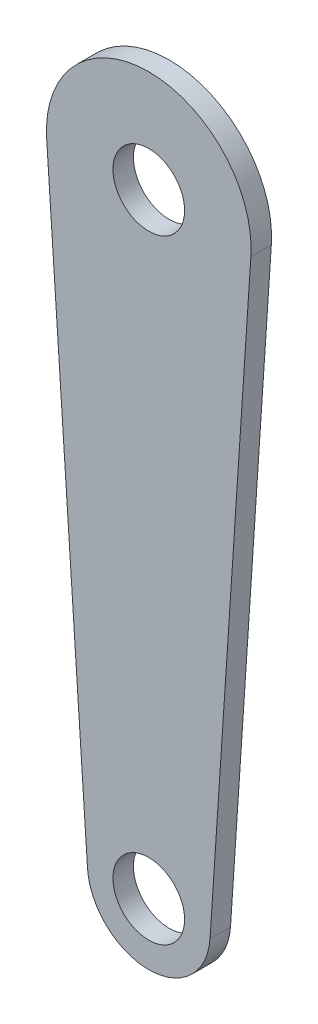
ISO-10303-21;
HEADER;
FILE_DESCRIPTION(('STEP AP214'),'2;1');
FILE_NAME('part.step','',(''),(''),'','','');
FILE_SCHEMA(('AUTOMOTIVE_DESIGN { 1 0 10303 214 1 1 1 1 }'));
ENDSEC;
DATA;
#1=APPLICATION_CONTEXT('core data for automotive mechanical design processes');
#2=APPLICATION_PROTOCOL_DEFINITION('international standard','automotive_design',2000,#1);
#3=PRODUCT_CONTEXT('',#1,'mechanical');
#4=PRODUCT('Part','Part','',(#3));
#5=PRODUCT_RELATED_PRODUCT_CATEGORY('part','',(#4));
#6=PRODUCT_DEFINITION_FORMATION('','',#4);
#7=PRODUCT_DEFINITION_CONTEXT('part definition',#1,'design');
#8=PRODUCT_DEFINITION('design','',#6,#7);
#9=PRODUCT_DEFINITION_SHAPE('','',#8);
#10=(LENGTH_UNIT() NAMED_UNIT(*) SI_UNIT(.MILLI.,.METRE.));
#11=(NAMED_UNIT(*) PLANE_ANGLE_UNIT() SI_UNIT($,.RADIAN.));
#12=(NAMED_UNIT(*) SI_UNIT($,.STERADIAN.) SOLID_ANGLE_UNIT());
#13=UNCERTAINTY_MEASURE_WITH_UNIT(LENGTH_MEASURE(1.E-05),#10,'distance_accuracy_value','');
#14=(GEOMETRIC_REPRESENTATION_CONTEXT(3) GLOBAL_UNCERTAINTY_ASSIGNED_CONTEXT((#13)) GLOBAL_UNIT_ASSIGNED_CONTEXT((#10,
#11,#12)) REPRESENTATION_CONTEXT('',''));
#15=CARTESIAN_POINT('',(0.,0.,0.));
#16=DIRECTION('',(0.,0.,1.));
#17=DIRECTION('',(1.,0.,0.));
#18=AXIS2_PLACEMENT_3D('',#15,#16,#17);
#19=CARTESIAN_POINT('',(0.,30.,1.));
#20=DIRECTION('',(0.,0.,1.));
#21=DIRECTION('',(1.,0.,0.));
#22=AXIS2_PLACEMENT_3D('',#19,#20,#21);
#23=PLANE('',#22);
#24=CARTESIAN_POINT('',(0.,30.,1.));
#25=DIRECTION('',(0.,0.,1.));
#26=DIRECTION('',(1.,0.,0.));
#27=AXIS2_PLACEMENT_3D('',#24,#25,#26);
#28=CIRCLE('',#27,1.75);
#29=CARTESIAN_POINT('',(1.75,30.,1.));
#30=VERTEX_POINT('',#29);
#31=EDGE_CURVE('E97',#30,#30,#28,.T.);
#32=ORIENTED_EDGE('',*,*,#31,.F.);
#33=EDGE_LOOP('',(#32));
#34=FACE_BOUND('',#33,.T.);
#35=CARTESIAN_POINT('',(0.,30.,1.));
#36=DIRECTION('',(0.,0.,1.));
#37=DIRECTION('',(1.,0.,0.));
#38=AXIS2_PLACEMENT_3D('',#35,#36,#37);
#39=CIRCLE('',#38,5.);
#40=CARTESIAN_POINT('',(4.98887651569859,29.6666666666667,1.));
#41=VERTEX_POINT('',#40);
#42=CARTESIAN_POINT('',(-4.98887651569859,29.6666666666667,1.));
#43=VERTEX_POINT('',#42);
#44=EDGE_CURVE('E82',#41,#43,#39,.T.);
#45=ORIENTED_EDGE('',*,*,#44,.T.);
#46=DIRECTION('',(0.0666666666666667,-0.997775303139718,0.));
#47=VECTOR('',#46,1.);
#48=CARTESIAN_POINT('',(-4.98887651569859,29.6666666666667,1.));
#49=LINE('',#48,#47);
#50=CARTESIAN_POINT('',(-2.99332590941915,-0.2,1.));
#51=VERTEX_POINT('',#50);
#52=EDGE_CURVE('E77',#43,#51,#49,.T.);
#53=ORIENTED_EDGE('',*,*,#52,.T.);
#54=CARTESIAN_POINT('',(0.,0.,1.));
#55=DIRECTION('',(0.,0.,1.));
#56=DIRECTION('',(1.,0.,0.));
#57=AXIS2_PLACEMENT_3D('',#54,#55,#56);
#58=CIRCLE('',#57,3.);
#59=CARTESIAN_POINT('',(2.99332590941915,-0.2,1.));
#60=VERTEX_POINT('',#59);
#61=EDGE_CURVE('E80',#51,#60,#58,.T.);
#62=ORIENTED_EDGE('',*,*,#61,.T.);
#63=DIRECTION('',(0.0666666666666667,0.997775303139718,0.));
#64=VECTOR('',#63,1.);
#65=CARTESIAN_POINT('',(4.98887651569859,29.6666666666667,1.));
#66=LINE('',#65,#64);
#67=EDGE_CURVE('E47',#60,#41,#66,.T.);
#68=ORIENTED_EDGE('',*,*,#67,.T.);
#69=EDGE_LOOP('',(#45,#53,#62,#68));
#70=FACE_BOUND('',#69,.T.);
#71=CARTESIAN_POINT('',(0.,0.,1.));
#72=DIRECTION('',(0.,0.,1.));
#73=DIRECTION('',(1.,0.,0.));
#74=AXIS2_PLACEMENT_3D('',#71,#72,#73);
#75=CIRCLE('',#74,1.75);
#76=CARTESIAN_POINT('',(1.75,0.,1.));
#77=VERTEX_POINT('',#76);
#78=EDGE_CURVE('E112',#77,#77,#75,.T.);
#79=ORIENTED_EDGE('',*,*,#78,.F.);
#80=EDGE_LOOP('',(#79));
#81=FACE_BOUND('',#80,.T.);
#82=ADVANCED_FACE('F30',(#34,#70,#81),#23,.T.);
#83=CARTESIAN_POINT('',(0.,30.,0.));
#84=DIRECTION('',(0.,0.,1.));
#85=DIRECTION('',(1.,0.,0.));
#86=AXIS2_PLACEMENT_3D('',#83,#84,#85);
#87=PLANE('',#86);
#88=CARTESIAN_POINT('',(0.,30.,0.));
#89=DIRECTION('',(0.,0.,1.));
#90=DIRECTION('',(1.,0.,0.));
#91=AXIS2_PLACEMENT_3D('',#88,#89,#90);
#92=CIRCLE('',#91,1.75);
#93=CARTESIAN_POINT('',(1.75,30.,0.));
#94=VERTEX_POINT('',#93);
#95=EDGE_CURVE('E109',#94,#94,#92,.T.);
#96=ORIENTED_EDGE('',*,*,#95,.T.);
#97=EDGE_LOOP('',(#96));
#98=FACE_BOUND('',#97,.T.);
#99=CARTESIAN_POINT('',(0.,30.,0.));
#100=DIRECTION('',(0.,0.,1.));
#101=DIRECTION('',(1.,0.,0.));
#102=AXIS2_PLACEMENT_3D('',#99,#100,#101);
#103=CIRCLE('',#102,5.);
#104=CARTESIAN_POINT('',(4.98887651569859,29.6666666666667,0.));
#105=VERTEX_POINT('',#104);
#106=CARTESIAN_POINT('',(-4.98887651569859,29.6666666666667,0.));
#107=VERTEX_POINT('',#106);
#108=EDGE_CURVE('E94',#105,#107,#103,.T.);
#109=ORIENTED_EDGE('',*,*,#108,.F.);
#110=DIRECTION('',(0.0666666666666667,0.997775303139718,0.));
#111=VECTOR('',#110,1.);
#112=CARTESIAN_POINT('',(4.98887651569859,29.6666666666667,0.));
#113=LINE('',#112,#111);
#114=CARTESIAN_POINT('',(2.99332590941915,-0.2,0.));
#115=VERTEX_POINT('',#114);
#116=EDGE_CURVE('E70',#115,#105,#113,.T.);
#117=ORIENTED_EDGE('',*,*,#116,.F.);
#118=CARTESIAN_POINT('',(0.,0.,0.));
#119=DIRECTION('',(0.,0.,1.));
#120=DIRECTION('',(1.,0.,0.));
#121=AXIS2_PLACEMENT_3D('',#118,#119,#120);
#122=CIRCLE('',#121,3.);
#123=CARTESIAN_POINT('',(-2.99332590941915,-0.2,0.));
#124=VERTEX_POINT('',#123);
#125=EDGE_CURVE('E64',#124,#115,#122,.T.);
#126=ORIENTED_EDGE('',*,*,#125,.F.);
#127=DIRECTION('',(0.0666666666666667,-0.997775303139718,0.));
#128=VECTOR('',#127,1.);
#129=CARTESIAN_POINT('',(-4.98887651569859,29.6666666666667,0.));
#130=LINE('',#129,#128);
#131=EDGE_CURVE('E86',#107,#124,#130,.T.);
#132=ORIENTED_EDGE('',*,*,#131,.F.);
#133=EDGE_LOOP('',(#109,#117,#126,#132));
#134=FACE_BOUND('',#133,.T.);
#135=CARTESIAN_POINT('',(0.,0.,0.));
#136=DIRECTION('',(0.,0.,1.));
#137=DIRECTION('',(1.,0.,0.));
#138=AXIS2_PLACEMENT_3D('',#135,#136,#137);
#139=CIRCLE('',#138,1.75);
#140=CARTESIAN_POINT('',(1.75,0.,0.));
#141=VERTEX_POINT('',#140);
#142=EDGE_CURVE('E115',#141,#141,#139,.T.);
#143=ORIENTED_EDGE('',*,*,#142,.T.);
#144=EDGE_LOOP('',(#143));
#145=FACE_BOUND('',#144,.T.);
#146=ADVANCED_FACE('F105',(#98,#134,#145),#87,.F.);
#147=CARTESIAN_POINT('',(0.,30.,1.));
#148=DIRECTION('',(0.,0.,-1.));
#149=DIRECTION('',(-1.,0.,0.));
#150=AXIS2_PLACEMENT_3D('',#147,#148,#149);
#151=CYLINDRICAL_SURFACE('',#150,5.);
#152=ORIENTED_EDGE('',*,*,#108,.T.);
#153=DIRECTION('',(0.,0.,-1.));
#154=VECTOR('',#153,1.);
#155=CARTESIAN_POINT('',(-4.98887651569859,29.6666666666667,1.));
#156=LINE('',#155,#154);
#157=EDGE_CURVE('E11',#43,#107,#156,.T.);
#158=ORIENTED_EDGE('',*,*,#157,.F.);
#159=ORIENTED_EDGE('',*,*,#44,.F.);
#160=DIRECTION('',(0.,0.,-1.));
#161=VECTOR('',#160,1.);
#162=CARTESIAN_POINT('',(4.98887651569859,29.6666666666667,1.));
#163=LINE('',#162,#161);
#164=EDGE_CURVE('E90',#41,#105,#163,.T.);
#165=ORIENTED_EDGE('',*,*,#164,.T.);
#166=EDGE_LOOP('',(#152,#158,#159,#165));
#167=FACE_BOUND('',#166,.T.);
#168=ADVANCED_FACE('F32',(#167),#151,.T.);
#169=CARTESIAN_POINT('',(-4.98887651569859,29.6666666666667,1.));
#170=DIRECTION('',(0.997775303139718,0.0666666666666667,0.));
#171=DIRECTION('',(-0.0666666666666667,0.997775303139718,0.));
#172=AXIS2_PLACEMENT_3D('',#169,#170,#171);
#173=PLANE('',#172);
#174=ORIENTED_EDGE('',*,*,#131,.T.);
#175=DIRECTION('',(0.,0.,-1.));
#176=VECTOR('',#175,1.);
#177=CARTESIAN_POINT('',(-2.99332590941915,-0.2,1.));
#178=LINE('',#177,#176);
#179=EDGE_CURVE('E39',#51,#124,#178,.T.);
#180=ORIENTED_EDGE('',*,*,#179,.F.);
#181=ORIENTED_EDGE('',*,*,#52,.F.);
#182=ORIENTED_EDGE('',*,*,#157,.T.);
#183=EDGE_LOOP('',(#174,#180,#181,#182));
#184=FACE_BOUND('',#183,.T.);
#185=ADVANCED_FACE('F85',(#184),#173,.F.);
#186=CARTESIAN_POINT('',(0.,0.,1.));
#187=DIRECTION('',(0.,0.,-1.));
#188=DIRECTION('',(-1.,0.,0.));
#189=AXIS2_PLACEMENT_3D('',#186,#187,#188);
#190=CYLINDRICAL_SURFACE('',#189,3.);
#191=ORIENTED_EDGE('',*,*,#125,.T.);
#192=DIRECTION('',(0.,0.,-1.));
#193=VECTOR('',#192,1.);
#194=CARTESIAN_POINT('',(2.99332590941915,-0.2,1.));
#195=LINE('',#194,#193);
#196=EDGE_CURVE('E87',#60,#115,#195,.T.);
#197=ORIENTED_EDGE('',*,*,#196,.F.);
#198=ORIENTED_EDGE('',*,*,#61,.F.);
#199=ORIENTED_EDGE('',*,*,#179,.T.);
#200=EDGE_LOOP('',(#191,#197,#198,#199));
#201=FACE_BOUND('',#200,.T.);
#202=ADVANCED_FACE('F88',(#201),#190,.T.);
#203=CARTESIAN_POINT('',(4.98887651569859,29.6666666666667,1.));
#204=DIRECTION('',(-0.997775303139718,0.0666666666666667,0.));
#205=DIRECTION('',(-0.0666666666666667,-0.997775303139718,0.));
#206=AXIS2_PLACEMENT_3D('',#203,#204,#205);
#207=PLANE('',#206);
#208=ORIENTED_EDGE('',*,*,#116,.T.);
#209=ORIENTED_EDGE('',*,*,#164,.F.);
#210=ORIENTED_EDGE('',*,*,#67,.F.);
#211=ORIENTED_EDGE('',*,*,#196,.T.);
#212=EDGE_LOOP('',(#208,#209,#210,#211));
#213=FACE_BOUND('',#212,.T.);
#214=ADVANCED_FACE('F102',(#213),#207,.F.);
#215=CARTESIAN_POINT('',(0.,30.,1.));
#216=DIRECTION('',(0.,0.,-1.));
#217=DIRECTION('',(-1.,0.,0.));
#218=AXIS2_PLACEMENT_3D('',#215,#216,#217);
#219=CYLINDRICAL_SURFACE('',#218,1.75);
#220=ORIENTED_EDGE('',*,*,#31,.T.);
#221=EDGE_LOOP('',(#220));
#222=FACE_BOUND('',#221,.T.);
#223=ORIENTED_EDGE('',*,*,#95,.F.);
#224=EDGE_LOOP('',(#223));
#225=FACE_BOUND('',#224,.T.);
#226=ADVANCED_FACE('F133',(#222,#225),#219,.F.);
#227=CARTESIAN_POINT('',(0.,0.,1.));
#228=DIRECTION('',(0.,0.,-1.));
#229=DIRECTION('',(-1.,0.,0.));
#230=AXIS2_PLACEMENT_3D('',#227,#228,#229);
#231=CYLINDRICAL_SURFACE('',#230,1.75);
#232=ORIENTED_EDGE('',*,*,#78,.T.);
#233=EDGE_LOOP('',(#232));
#234=FACE_BOUND('',#233,.T.);
#235=ORIENTED_EDGE('',*,*,#142,.F.);
#236=EDGE_LOOP('',(#235));
#237=FACE_BOUND('',#236,.T.);
#238=ADVANCED_FACE('F121',(#234,#237),#231,.F.);
#239=CLOSED_SHELL('',(#82,#146,#168,#185,#202,#214,#226,#238));
#240=MANIFOLD_SOLID_BREP('B2',#239);
#241=ADVANCED_BREP_SHAPE_REPRESENTATION('',(#18,#240),#14);
#242=SHAPE_DEFINITION_REPRESENTATION(#9,#241);
ENDSEC;
END-ISO-10303-21;
